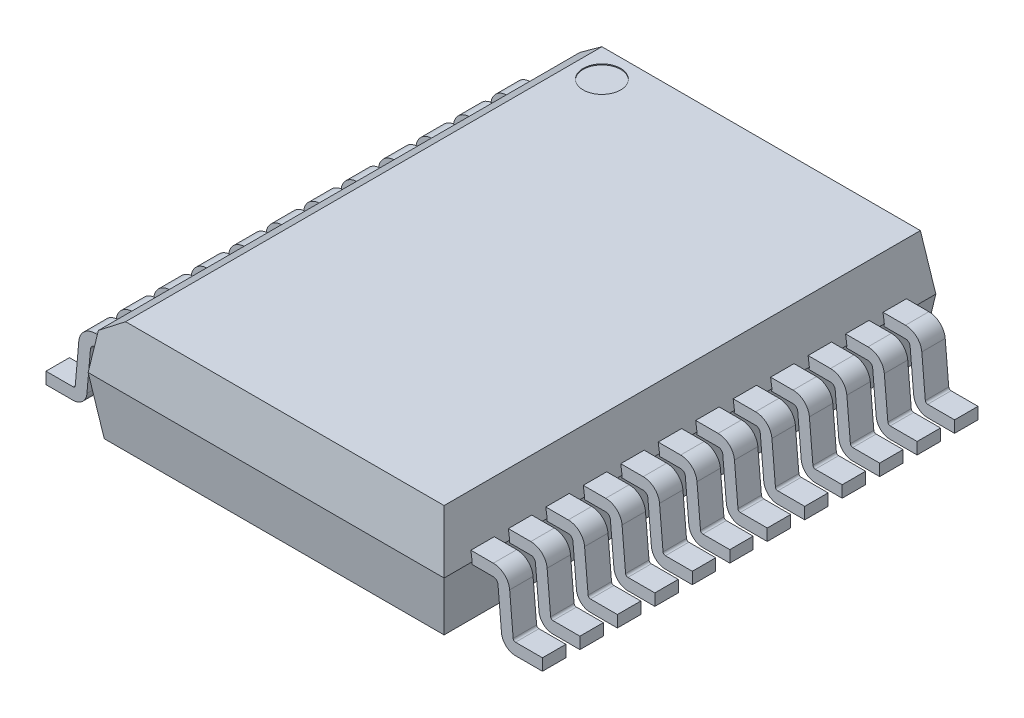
from build123d import *

# Parameters (mm, degrees)
EXTRUDE_1_DEPTH              = 0.25
SKETCH_8396_W                = 7.6
SKETCH_8396_H                = 10.5
EXTRUDE_8454_DEPTH           = 1.175
EXTRUDE_8454_TAPER           = 8
EXTRUDE_8454_OTHER_WAY_DEPTH = 1.225
EXTRUDE_8454_OTHER_WAY_TAPER = 8
PATTERN_LINEAR_8533_COUNT    = 12
PATTERN_LINEAR_8533_PITCH    = 0.8
CHAMFER_1_SIZE               = 0.4
CHAMFER_1_SIZE2              = 0.469982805
SKETCH_3_R                   = 0.4
CUT_EXTRUDE_3_DEPTH          = 0.02
SKTHERMALPAD_W               = 5
SKTHERMALPAD_H               = 5.5
THERMALPAD_DEPTH             = 1.275


with BuildPart() as part:
    # Sketch 1 → Extrude 1 (new, symmetric)
    with BuildSketch(Plane.XY.offset(-4.4)):
        with BuildLine():
            Line((-5.3, 0), (-4.724899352, 0))
            ThreePointArc((-4.724899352, 0), (-4.52222229, 0.078816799), (-4.426040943, 0.273853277))
            Line((-4.426040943, 0.273853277), (-4.35081274, 1.133715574))
            ThreePointArc((-4.35081274, 1.133715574), (-4.318752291, 1.198727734), (-4.25119327, 1.225))
            Line((-4.25119327, 1.225), (4.25119327, 1.225))
            ThreePointArc((4.25119327, 1.225), (4.318752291, 1.198727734), (4.35081274, 1.133715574))
            Line((4.35081274, 1.133715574), (4.426040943, 0.273853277))
            ThreePointArc((4.426040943, 0.273853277), (4.52222229, 0.078816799), (4.724899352, 0))
            Line((4.724899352, 0), (5.3, 0))
            Line((5.3, 0), (5.3, 0.25))
            Line((5.3, 0.25), (4.724899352, 0.25))
            ThreePointArc((4.724899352, 0.25), (4.691119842, 0.263136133), (4.675089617, 0.295642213))
            Line((4.675089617, 0.295642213), (4.599861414, 1.15550451))
            ThreePointArc((4.599861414, 1.15550451), (4.487649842, 1.383047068), (4.25119327, 1.475))
            Line((4.25119327, 1.475), (-4.25119327, 1.475))
            ThreePointArc((-4.25119327, 1.475), (-4.487649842, 1.383047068), (-4.599861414, 1.15550451))
            Line((-4.599861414, 1.15550451), (-4.675089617, 0.295642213))
            ThreePointArc((-4.675089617, 0.295642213), (-4.691119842, 0.263136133), (-4.724899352, 0.25))
            Line((-4.724899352, 0.25), (-5.3, 0.25))
            Line((-5.3, 0.25), (-5.3, 0))
        make_face()
    extrude_1 = extrude(amount=EXTRUDE_1_DEPTH, both=True)

    # Sketch 8396 → Extrude 8454 (add)
    with BuildSketch(Plane(origin=(0, 1.275, 0), x_dir=(1, 0, 0), z_dir=(0, 1, 0))):
        Rectangle(SKETCH_8396_W, SKETCH_8396_H)
    extrude(amount=EXTRUDE_8454_DEPTH, taper=EXTRUDE_8454_TAPER)

    # Sketch 8396 → Extrude 8454 other way (add)
    with BuildSketch(Plane(origin=(0, 1.275, 0), x_dir=(1, 0, 0), z_dir=(0, 1, 0))):
        Rectangle(SKETCH_8396_W, SKETCH_8396_H)
    extrude(amount=-EXTRUDE_8454_OTHER_WAY_DEPTH, taper=EXTRUDE_8454_OTHER_WAY_TAPER)

    # Pattern Linear 8533: Extrude 1 ×12
    with Locations(*[(0, 0, i * PATTERN_LINEAR_8533_PITCH) for i in range(1, PATTERN_LINEAR_8533_COUNT)]):
        add(extrude_1)

    # Chamfer 1
    chamfer_1_edges = [part.edges().sort_by_distance(p)[0] for p in [
        (-3.634864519, 2.45, 0),
    ]]
    chamfer_1_side = [part.faces().sort_by_distance(p)[0] for p in [
        (-3.710407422, 1.912484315, 0),
    ]]
    chamfer(chamfer_1_edges, length=CHAMFER_1_SIZE, length2=CHAMFER_1_SIZE2, reference=chamfer_1_side[0])

    # Sketch 3 → Cut-Extrude 3 (cut)
    with BuildSketch(Plane(origin=(0, 2.45, 0), x_dir=(1, 0, 0), z_dir=(0, 1, 0))):
        with Locations(Location((-2.564881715, 4.484864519, 0), (0, 0, 270))):
            Circle(SKETCH_3_R)
    extrude(amount=-CUT_EXTRUDE_3_DEPTH, mode=Mode.SUBTRACT)

    # SkThermalPad → ThermalPad (add)
    with BuildSketch(Plane(origin=(0, 1.275, 0), x_dir=(-1, 0, 0), z_dir=(0, 1, 0))):
        Rectangle(SKTHERMALPAD_W, SKTHERMALPAD_H)
    extrude(amount=-THERMALPAD_DEPTH)


solid = part.part
